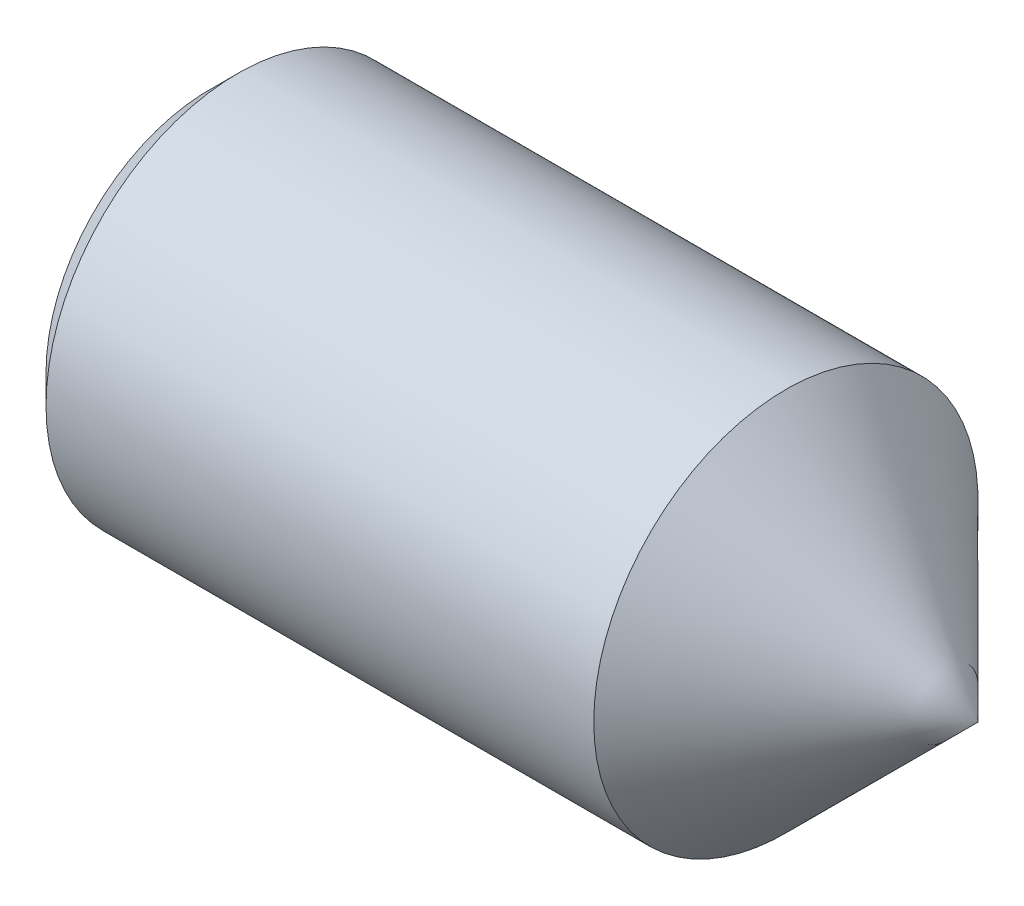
ISO-10303-21;
HEADER;
FILE_DESCRIPTION(('STEP AP214'),'2;1');
FILE_NAME('part.step','',(''),(''),'','','');
FILE_SCHEMA(('AUTOMOTIVE_DESIGN { 1 0 10303 214 1 1 1 1 }'));
ENDSEC;
DATA;
#1=APPLICATION_CONTEXT('core data for automotive mechanical design processes');
#2=APPLICATION_PROTOCOL_DEFINITION('international standard','automotive_design',2000,#1);
#3=PRODUCT_CONTEXT('',#1,'mechanical');
#4=PRODUCT('Part','Part','',(#3));
#5=PRODUCT_RELATED_PRODUCT_CATEGORY('part','',(#4));
#6=PRODUCT_DEFINITION_FORMATION('','',#4);
#7=PRODUCT_DEFINITION_CONTEXT('part definition',#1,'design');
#8=PRODUCT_DEFINITION('design','',#6,#7);
#9=PRODUCT_DEFINITION_SHAPE('','',#8);
#10=(LENGTH_UNIT() NAMED_UNIT(*) SI_UNIT(.MILLI.,.METRE.));
#11=(NAMED_UNIT(*) PLANE_ANGLE_UNIT() SI_UNIT($,.RADIAN.));
#12=(NAMED_UNIT(*) SI_UNIT($,.STERADIAN.) SOLID_ANGLE_UNIT());
#13=UNCERTAINTY_MEASURE_WITH_UNIT(LENGTH_MEASURE(1.E-05),#10,'distance_accuracy_value','');
#14=(GEOMETRIC_REPRESENTATION_CONTEXT(3) GLOBAL_UNCERTAINTY_ASSIGNED_CONTEXT((#13)) GLOBAL_UNIT_ASSIGNED_CONTEXT((#10,
#11,#12)) REPRESENTATION_CONTEXT('',''));
#15=CARTESIAN_POINT('',(0.,0.,0.));
#16=DIRECTION('',(0.,0.,1.));
#17=DIRECTION('',(1.,0.,0.));
#18=AXIS2_PLACEMENT_3D('',#15,#16,#17);
#19=CARTESIAN_POINT('',(0.,0.,0.));
#20=DIRECTION('',(-1.,0.,0.));
#21=DIRECTION('',(0.,0.,1.));
#22=AXIS2_PLACEMENT_3D('',#19,#20,#21);
#23=PLANE('',#22);
#24=CARTESIAN_POINT('',(0.,0.,0.));
#25=DIRECTION('',(-1.,0.,0.));
#26=DIRECTION('',(0.,0.,1.));
#27=AXIS2_PLACEMENT_3D('',#24,#25,#26);
#28=CIRCLE('',#27,10.81024);
#29=CARTESIAN_POINT('',(0.,0.,10.81024));
#30=VERTEX_POINT('',#29);
#31=EDGE_CURVE('E11',#30,#30,#28,.T.);
#32=ORIENTED_EDGE('',*,*,#31,.T.);
#33=EDGE_LOOP('',(#32));
#34=FACE_BOUND('',#33,.T.);
#35=DIRECTION('',(0.,0.,-1.));
#36=VECTOR('',#35,1.);
#37=CARTESIAN_POINT('',(0.,7.1374,4.12077981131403));
#38=LINE('',#37,#36);
#39=CARTESIAN_POINT('',(0.,7.1374,4.12077981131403));
#40=VERTEX_POINT('',#39);
#41=CARTESIAN_POINT('',(0.,7.1374,-4.12077981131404));
#42=VERTEX_POINT('',#41);
#43=EDGE_CURVE('E94',#40,#42,#38,.T.);
#44=ORIENTED_EDGE('',*,*,#43,.F.);
#45=DIRECTION('',(0.,-0.866025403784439,0.5));
#46=VECTOR('',#45,1.);
#47=CARTESIAN_POINT('',(0.,7.1374,4.12077981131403));
#48=LINE('',#47,#46);
#49=CARTESIAN_POINT('',(0.,0.,8.24155962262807));
#50=VERTEX_POINT('',#49);
#51=EDGE_CURVE('E47',#40,#50,#48,.T.);
#52=ORIENTED_EDGE('',*,*,#51,.T.);
#53=DIRECTION('',(0.,0.866025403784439,0.5));
#54=VECTOR('',#53,1.);
#55=CARTESIAN_POINT('',(0.,-7.13739999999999,4.12077981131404));
#56=LINE('',#55,#54);
#57=CARTESIAN_POINT('',(0.,-7.13739999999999,4.12077981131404));
#58=VERTEX_POINT('',#57);
#59=EDGE_CURVE('E100',#58,#50,#56,.T.);
#60=ORIENTED_EDGE('',*,*,#59,.F.);
#61=DIRECTION('',(0.,0.,-1.));
#62=VECTOR('',#61,1.);
#63=CARTESIAN_POINT('',(0.,-7.13739999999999,4.12077981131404));
#64=LINE('',#63,#62);
#65=CARTESIAN_POINT('',(0.,-7.13739999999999,-4.12077981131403));
#66=VERTEX_POINT('',#65);
#67=EDGE_CURVE('E120',#58,#66,#64,.T.);
#68=ORIENTED_EDGE('',*,*,#67,.T.);
#69=DIRECTION('',(0.,0.866025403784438,-0.500000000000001));
#70=VECTOR('',#69,1.);
#71=CARTESIAN_POINT('',(0.,-7.13739999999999,-4.12077981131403));
#72=LINE('',#71,#70);
#73=CARTESIAN_POINT('',(0.,0.,-8.24155962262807));
#74=VERTEX_POINT('',#73);
#75=EDGE_CURVE('E123',#66,#74,#72,.T.);
#76=ORIENTED_EDGE('',*,*,#75,.T.);
#77=DIRECTION('',(0.,-0.866025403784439,-0.5));
#78=VECTOR('',#77,1.);
#79=CARTESIAN_POINT('',(0.,7.1374,-4.12077981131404));
#80=LINE('',#79,#78);
#81=EDGE_CURVE('E126',#42,#74,#80,.T.);
#82=ORIENTED_EDGE('',*,*,#81,.F.);
#83=EDGE_LOOP('',(#44,#52,#60,#68,#76,#82));
#84=FACE_BOUND('',#83,.T.);
#85=ADVANCED_FACE('F33',(#34,#84),#23,.T.);
#86=CARTESIAN_POINT('',(0.,0.,0.));
#87=DIRECTION('',(1.,0.,0.));
#88=DIRECTION('',(0.,0.,-1.));
#89=AXIS2_PLACEMENT_3D('',#86,#87,#88);
#90=CONICAL_SURFACE('',#89,10.81024,0.785398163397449);
#91=CARTESIAN_POINT('',(1.88976,0.,0.));
#92=DIRECTION('',(-1.,0.,0.));
#93=DIRECTION('',(0.,0.,1.));
#94=AXIS2_PLACEMENT_3D('',#91,#92,#93);
#95=CIRCLE('',#94,12.7);
#96=CARTESIAN_POINT('',(1.88976,0.,12.7));
#97=VERTEX_POINT('',#96);
#98=EDGE_CURVE('E40',#97,#97,#95,.T.);
#99=ORIENTED_EDGE('',*,*,#98,.T.);
#100=EDGE_LOOP('',(#99));
#101=FACE_BOUND('',#100,.T.);
#102=ORIENTED_EDGE('',*,*,#31,.F.);
#103=EDGE_LOOP('',(#102));
#104=FACE_BOUND('',#103,.T.);
#105=ADVANCED_FACE('F143',(#101,#104),#90,.T.);
#106=CARTESIAN_POINT('',(-12.7,0.,0.));
#107=DIRECTION('',(-1.,0.,0.));
#108=DIRECTION('',(0.,0.,1.));
#109=AXIS2_PLACEMENT_3D('',#106,#107,#108);
#110=CYLINDRICAL_SURFACE('',#109,12.7);
#111=CARTESIAN_POINT('',(38.1,0.,0.));
#112=DIRECTION('',(-1.,0.,0.));
#113=DIRECTION('',(0.,0.,1.));
#114=AXIS2_PLACEMENT_3D('',#111,#112,#113);
#115=CIRCLE('',#114,12.7);
#116=CARTESIAN_POINT('',(38.1,0.,12.7));
#117=VERTEX_POINT('',#116);
#118=EDGE_CURVE('E101',#117,#117,#115,.T.);
#119=ORIENTED_EDGE('',*,*,#118,.T.);
#120=EDGE_LOOP('',(#119));
#121=FACE_BOUND('',#120,.T.);
#122=ORIENTED_EDGE('',*,*,#98,.F.);
#123=EDGE_LOOP('',(#122));
#124=FACE_BOUND('',#123,.T.);
#125=ADVANCED_FACE('F146',(#121,#124),#110,.T.);
#126=CARTESIAN_POINT('',(38.1,0.,0.));
#127=DIRECTION('',(-1.,0.,0.));
#128=DIRECTION('',(0.,0.,1.));
#129=AXIS2_PLACEMENT_3D('',#126,#127,#128);
#130=CONICAL_SURFACE('',#129,12.7,0.785398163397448);
#131=CARTESIAN_POINT('',(50.8,0.,0.));
#132=VERTEX_POINT('',#131);
#133=VERTEX_LOOP('',#132);
#134=FACE_BOUND('',#133,.T.);
#135=ORIENTED_EDGE('',*,*,#118,.F.);
#136=EDGE_LOOP('',(#135));
#137=FACE_BOUND('',#136,.T.);
#138=ADVANCED_FACE('F148',(#134,#137),#130,.T.);
#139=CARTESIAN_POINT('',(14.2748,7.1374,4.12077981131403));
#140=DIRECTION('',(0.,-0.5,-0.866025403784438));
#141=DIRECTION('',(0.,0.866025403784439,-0.5));
#142=AXIS2_PLACEMENT_3D('',#139,#140,#141);
#143=PLANE('',#142);
#144=ORIENTED_EDGE('',*,*,#51,.F.);
#145=DIRECTION('',(-1.,0.,0.));
#146=VECTOR('',#145,1.);
#147=CARTESIAN_POINT('',(14.2748,7.1374,4.12077981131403));
#148=LINE('',#147,#146);
#149=CARTESIAN_POINT('',(14.2748,7.1374,4.12077981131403));
#150=VERTEX_POINT('',#149);
#151=EDGE_CURVE('E88',#150,#40,#148,.T.);
#152=ORIENTED_EDGE('',*,*,#151,.F.);
#153=DIRECTION('',(0.,-0.866025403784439,0.5));
#154=VECTOR('',#153,1.);
#155=CARTESIAN_POINT('',(14.2748,7.1374,4.12077981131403));
#156=LINE('',#155,#154);
#157=CARTESIAN_POINT('',(14.2748,0.,8.24155962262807));
#158=VERTEX_POINT('',#157);
#159=EDGE_CURVE('E83',#150,#158,#156,.T.);
#160=ORIENTED_EDGE('',*,*,#159,.T.);
#161=DIRECTION('',(-1.,0.,0.));
#162=VECTOR('',#161,1.);
#163=CARTESIAN_POINT('',(14.2748,0.,8.24155962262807));
#164=LINE('',#163,#162);
#165=EDGE_CURVE('E86',#158,#50,#164,.T.);
#166=ORIENTED_EDGE('',*,*,#165,.T.);
#167=EDGE_LOOP('',(#144,#152,#160,#166));
#168=FACE_BOUND('',#167,.T.);
#169=ADVANCED_FACE('F85',(#168),#143,.T.);
#170=CARTESIAN_POINT('',(14.2748,-7.13739999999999,4.12077981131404));
#171=DIRECTION('',(0.,-0.5,0.866025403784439));
#172=DIRECTION('',(0.,-0.866025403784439,-0.5));
#173=AXIS2_PLACEMENT_3D('',#170,#171,#172);
#174=PLANE('',#173);
#175=ORIENTED_EDGE('',*,*,#59,.T.);
#176=ORIENTED_EDGE('',*,*,#165,.F.);
#177=DIRECTION('',(0.,0.866025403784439,0.5));
#178=VECTOR('',#177,1.);
#179=CARTESIAN_POINT('',(14.2748,-7.13739999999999,4.12077981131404));
#180=LINE('',#179,#178);
#181=CARTESIAN_POINT('',(14.2748,-7.13739999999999,4.12077981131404));
#182=VERTEX_POINT('',#181);
#183=EDGE_CURVE('E93',#182,#158,#180,.T.);
#184=ORIENTED_EDGE('',*,*,#183,.F.);
#185=DIRECTION('',(-1.,0.,0.));
#186=VECTOR('',#185,1.);
#187=CARTESIAN_POINT('',(14.2748,-7.13739999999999,4.12077981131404));
#188=LINE('',#187,#186);
#189=EDGE_CURVE('E102',#182,#58,#188,.T.);
#190=ORIENTED_EDGE('',*,*,#189,.T.);
#191=EDGE_LOOP('',(#175,#176,#184,#190));
#192=FACE_BOUND('',#191,.T.);
#193=ADVANCED_FACE('F98',(#192),#174,.F.);
#194=CARTESIAN_POINT('',(14.2748,-7.13739999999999,4.12077981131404));
#195=DIRECTION('',(0.,1.,0.));
#196=DIRECTION('',(0.,0.,1.));
#197=AXIS2_PLACEMENT_3D('',#194,#195,#196);
#198=PLANE('',#197);
#199=ORIENTED_EDGE('',*,*,#67,.F.);
#200=ORIENTED_EDGE('',*,*,#189,.F.);
#201=DIRECTION('',(0.,0.,-1.));
#202=VECTOR('',#201,1.);
#203=CARTESIAN_POINT('',(14.2748,-7.13739999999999,4.12077981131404));
#204=LINE('',#203,#202);
#205=CARTESIAN_POINT('',(14.2748,-7.13739999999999,-4.12077981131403));
#206=VERTEX_POINT('',#205);
#207=EDGE_CURVE('E107',#182,#206,#204,.T.);
#208=ORIENTED_EDGE('',*,*,#207,.T.);
#209=DIRECTION('',(-1.,0.,0.));
#210=VECTOR('',#209,1.);
#211=CARTESIAN_POINT('',(14.2748,-7.13739999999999,-4.12077981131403));
#212=LINE('',#211,#210);
#213=EDGE_CURVE('E136',#206,#66,#212,.T.);
#214=ORIENTED_EDGE('',*,*,#213,.T.);
#215=EDGE_LOOP('',(#199,#200,#208,#214));
#216=FACE_BOUND('',#215,.T.);
#217=ADVANCED_FACE('F176',(#216),#198,.T.);
#218=CARTESIAN_POINT('',(14.2748,-7.13739999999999,-4.12077981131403));
#219=DIRECTION('',(0.,0.500000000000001,0.866025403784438));
#220=DIRECTION('',(0.,-0.866025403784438,0.500000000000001));
#221=AXIS2_PLACEMENT_3D('',#218,#219,#220);
#222=PLANE('',#221);
#223=ORIENTED_EDGE('',*,*,#75,.F.);
#224=ORIENTED_EDGE('',*,*,#213,.F.);
#225=DIRECTION('',(0.,0.866025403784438,-0.500000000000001));
#226=VECTOR('',#225,1.);
#227=CARTESIAN_POINT('',(14.2748,-7.13739999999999,-4.12077981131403));
#228=LINE('',#227,#226);
#229=CARTESIAN_POINT('',(14.2748,0.,-8.24155962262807));
#230=VERTEX_POINT('',#229);
#231=EDGE_CURVE('E109',#206,#230,#228,.T.);
#232=ORIENTED_EDGE('',*,*,#231,.T.);
#233=DIRECTION('',(-1.,0.,0.));
#234=VECTOR('',#233,1.);
#235=CARTESIAN_POINT('',(14.2748,0.,-8.24155962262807));
#236=LINE('',#235,#234);
#237=EDGE_CURVE('E134',#230,#74,#236,.T.);
#238=ORIENTED_EDGE('',*,*,#237,.T.);
#239=EDGE_LOOP('',(#223,#224,#232,#238));
#240=FACE_BOUND('',#239,.T.);
#241=ADVANCED_FACE('F172',(#240),#222,.T.);
#242=CARTESIAN_POINT('',(14.2748,7.1374,-4.12077981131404));
#243=DIRECTION('',(0.,0.5,-0.866025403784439));
#244=DIRECTION('',(0.,0.866025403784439,0.5));
#245=AXIS2_PLACEMENT_3D('',#242,#243,#244);
#246=PLANE('',#245);
#247=ORIENTED_EDGE('',*,*,#81,.T.);
#248=ORIENTED_EDGE('',*,*,#237,.F.);
#249=DIRECTION('',(0.,-0.866025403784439,-0.5));
#250=VECTOR('',#249,1.);
#251=CARTESIAN_POINT('',(14.2748,7.1374,-4.12077981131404));
#252=LINE('',#251,#250);
#253=CARTESIAN_POINT('',(14.2748,7.1374,-4.12077981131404));
#254=VERTEX_POINT('',#253);
#255=EDGE_CURVE('E113',#254,#230,#252,.T.);
#256=ORIENTED_EDGE('',*,*,#255,.F.);
#257=DIRECTION('',(-1.,0.,0.));
#258=VECTOR('',#257,1.);
#259=CARTESIAN_POINT('',(14.2748,7.1374,-4.12077981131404));
#260=LINE('',#259,#258);
#261=EDGE_CURVE('E132',#254,#42,#260,.T.);
#262=ORIENTED_EDGE('',*,*,#261,.T.);
#263=EDGE_LOOP('',(#247,#248,#256,#262));
#264=FACE_BOUND('',#263,.T.);
#265=ADVANCED_FACE('F169',(#264),#246,.F.);
#266=CARTESIAN_POINT('',(14.2748,7.1374,4.12077981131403));
#267=DIRECTION('',(0.,1.,0.));
#268=DIRECTION('',(0.,0.,1.));
#269=AXIS2_PLACEMENT_3D('',#266,#267,#268);
#270=PLANE('',#269);
#271=ORIENTED_EDGE('',*,*,#43,.T.);
#272=ORIENTED_EDGE('',*,*,#261,.F.);
#273=DIRECTION('',(0.,0.,-1.));
#274=VECTOR('',#273,1.);
#275=CARTESIAN_POINT('',(14.2748,7.1374,4.12077981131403));
#276=LINE('',#275,#274);
#277=EDGE_CURVE('E116',#150,#254,#276,.T.);
#278=ORIENTED_EDGE('',*,*,#277,.F.);
#279=ORIENTED_EDGE('',*,*,#151,.T.);
#280=EDGE_LOOP('',(#271,#272,#278,#279));
#281=FACE_BOUND('',#280,.T.);
#282=ADVANCED_FACE('F165',(#281),#270,.F.);
#283=CARTESIAN_POINT('',(14.2748,14.2748,0.));
#284=DIRECTION('',(1.,0.,0.));
#285=DIRECTION('',(0.,0.,-1.));
#286=AXIS2_PLACEMENT_3D('',#283,#284,#285);
#287=PLANE('',#286);
#288=ORIENTED_EDGE('',*,*,#159,.F.);
#289=ORIENTED_EDGE('',*,*,#277,.T.);
#290=ORIENTED_EDGE('',*,*,#255,.T.);
#291=ORIENTED_EDGE('',*,*,#231,.F.);
#292=ORIENTED_EDGE('',*,*,#207,.F.);
#293=ORIENTED_EDGE('',*,*,#183,.T.);
#294=EDGE_LOOP('',(#288,#289,#290,#291,#292,#293));
#295=FACE_BOUND('',#294,.T.);
#296=ADVANCED_FACE('F105',(#295),#287,.F.);
#297=CLOSED_SHELL('',(#85,#105,#125,#138,#169,#193,#217,#241,#265,#282,#296));
#298=MANIFOLD_SOLID_BREP('B2',#297);
#299=ADVANCED_BREP_SHAPE_REPRESENTATION('',(#18,#298),#14);
#300=SHAPE_DEFINITION_REPRESENTATION(#9,#299);
ENDSEC;
END-ISO-10303-21;
